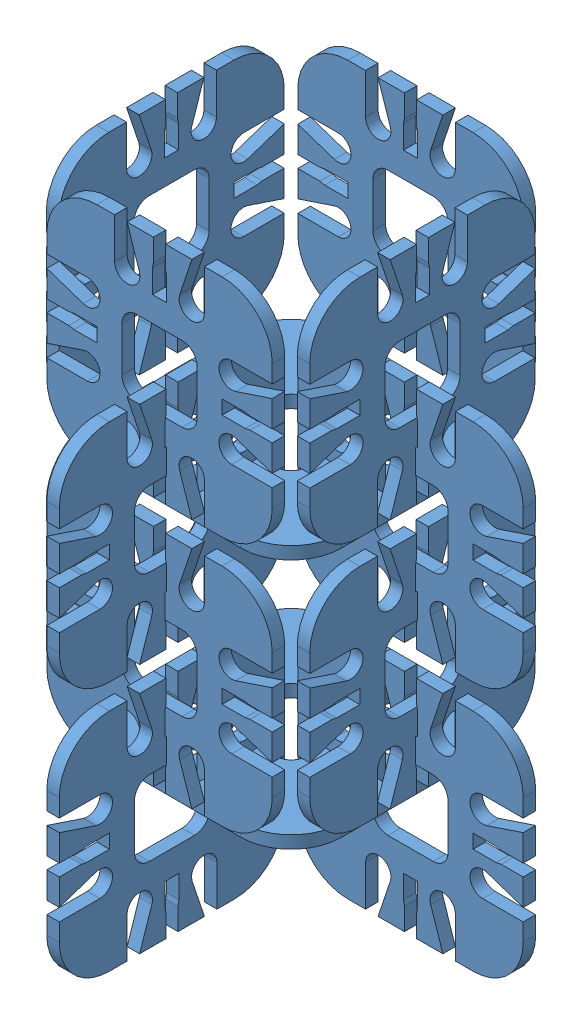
SolidWorks assembly Assem3.SLDASM, configuration Default (file format 9000). Lengths in mm.
Overall size (95 120.1 95).
22 component instances, 1 part files, 3 mates.
Components (placement in the parent):
- PlateSubAssly2-1: PlateSubAssly2.SLDASM [Default] at (8.4013 -27.6107 5.8328) size (95 70.1 95)
  - PlateSubAssly-1: PlateSubAssly.SLDASM [Default] at (23.1752 18.6961 41.0238) size (95 45.1 95)
    - Laser Cut Part-1: Laser Cut Part.SLDPRT [Default] at (12.3206 21.8843 37.1409) size (45 2.5 45)
    - Laser Cut Part-2: Laser Cut Part.SLDPRT [Default] at (-12.6794 23.1843 35.9409) x (1 0 0) z (0 -1 0) size (45 2.5 45)
    - Laser Cut Part-3: Laser Cut Part.SLDPRT [Default] at (13.5206 23.0843 62.1409) x (0 -1 0) z (0 0 -1) size (45 2.5 45)
    - Laser Cut Part-4: Laser Cut Part.SLDPRT [Default] at (37.3206 23.0843 38.3409) x (1 0 0) z (0 1 0) size (45 2.5 45)
    - Laser Cut Part-5: Laser Cut Part.SLDPRT [Default] at (11.0206 23.0843 12.1409) x (0 -1 0) z (0 0 1) size (45 2.5 45)
  - Laser Cut Part-1: Laser Cut Part.SLDPRT [Default] at (35.3958 66.7804 101.8646) x (0 -1 0) z (-1 0 0) size (45 2.5 45)
  - Laser Cut Part-2: Laser Cut Part.SLDPRT [Default] at (11.6958 66.8804 78.2646) x (0 0 1) z (0 -1 0) size (45 2.5 45)
  - Laser Cut Part-3: Laser Cut Part.SLDPRT [Default] at (35.4958 66.7804 51.8646) x (1 0 0) z (0 -1 0) size (45 2.5 45)
  - Laser Cut Part-4: Laser Cut Part.SLDPRT [Default] at (61.6958 66.7804 78.1646) x (0 0 -1) z (0 1 0) size (45 2.5 45)
- PlateSubAssly2-2: PlateSubAssly2.SLDASM [Default] at (8.4013 22.3893 5.8328) size (95 70.1 95)
  - PlateSubAssly-1: PlateSubAssly.SLDASM [Default] at (23.1752 18.6961 41.0238) size (95 45.1 95)
    - Laser Cut Part-1: Laser Cut Part.SLDPRT [Default] at (12.3206 21.8843 37.1409) size (45 2.5 45)
    - Laser Cut Part-2: Laser Cut Part.SLDPRT [Default] at (-12.6794 23.1843 35.9409) x (1 0 0) z (0 -1 0) size (45 2.5 45)
    - Laser Cut Part-3: Laser Cut Part.SLDPRT [Default] at (13.5206 23.0843 62.1409) x (0 -1 0) z (0 0 -1) size (45 2.5 45)
    - Laser Cut Part-4: Laser Cut Part.SLDPRT [Default] at (37.3206 23.0843 38.3409) x (1 0 0) z (0 1 0) size (45 2.5 45)
    - Laser Cut Part-5: Laser Cut Part.SLDPRT [Default] at (11.0206 23.0843 12.1409) x (0 -1 0) z (0 0 1) size (45 2.5 45)
  - Laser Cut Part-1: Laser Cut Part.SLDPRT [Default] at (35.3958 66.7804 101.8646) x (0 -1 0) z (-1 0 0) size (45 2.5 45)
  - Laser Cut Part-2: Laser Cut Part.SLDPRT [Default] at (11.6958 66.8804 78.2646) x (0 0 1) z (0 -1 0) size (45 2.5 45)
  - Laser Cut Part-3: Laser Cut Part.SLDPRT [Default] at (35.4958 66.7804 51.8646) x (1 0 0) z (0 -1 0) size (45 2.5 45)
  - Laser Cut Part-4: Laser Cut Part.SLDPRT [Default] at (61.6958 66.7804 78.1646) x (0 0 -1) z (0 1 0) size (45 2.5 45)
Mates (geometry in assembly coordinates):
- Coincident1: coincident: plane of PlateSubAssly2-1/Laser Cut Part-4 through (67.5971 51.6697 82.5974) normal (0 1 0); plane of PlateSubAssly2-2/PlateSubAssly-1/Laser Cut Part-4 through (67.4971 51.6697 82.6974) normal (0 -1 0)
- Coincident2: coincident: plane of PlateSubAssly2-1/PlateSubAssly-1/Laser Cut Part-4 through (75.3336 28.5739 85.1974) normal (0 0 1); plane of PlateSubAssly2-2/PlateSubAssly-1/Laser Cut Part-4 through (75.3336 78.5739 85.1974) normal (0 0 1)
- Coincident3: coincident aligned: plane of PlateSubAssly2-1/Laser Cut Part-4 through (70.0971 53.5739 77.5609) normal (1 0 0); plane of PlateSubAssly2-2/Laser Cut Part-4 through (70.0971 103.5739 77.5609) normal (1 0 0)
